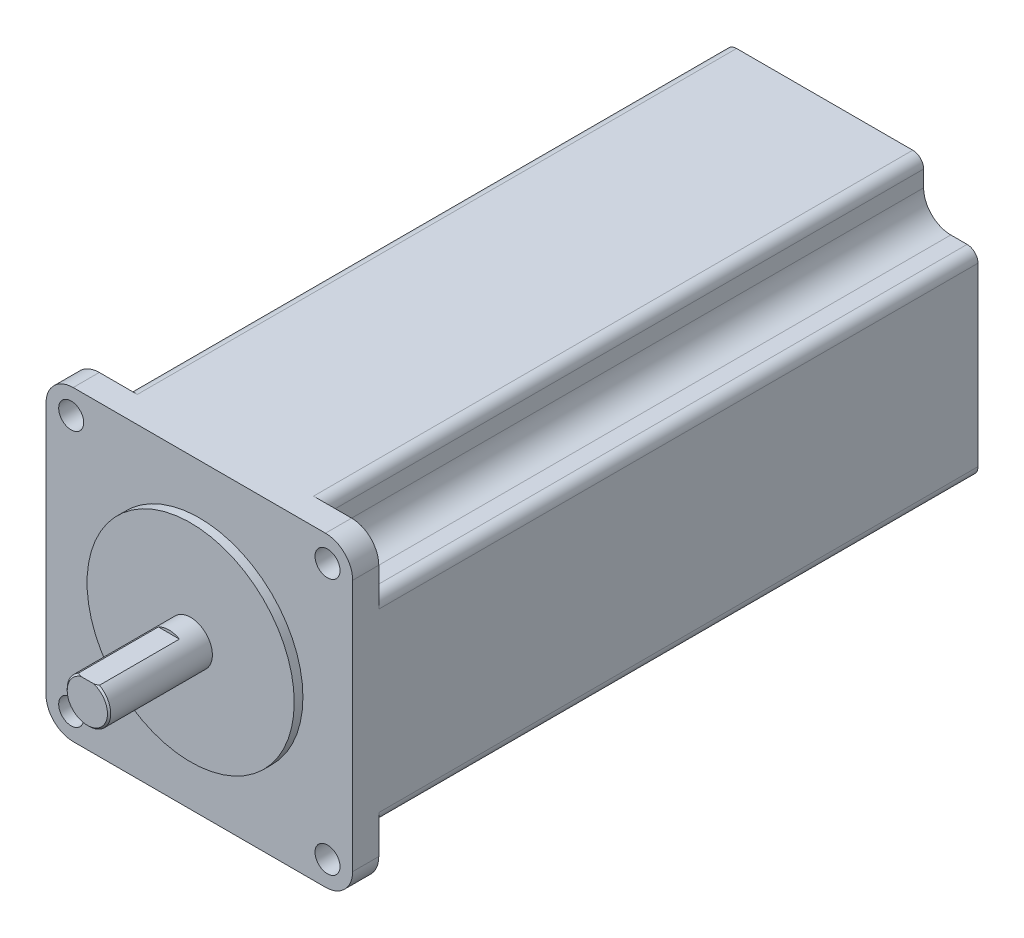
from build123d import *

# Parameters (mm, degrees)
SKETCH_1_R          = 19.05
EXTRUDE_1_DEPTH     = 1.6
SKETCH_2_R          = 4
EXTRUDE_2_DEPTH     = 19
EXTRUDE_3_DEPTH     = 115
CUT_EXTRUDE_START   = -110.2
CUT_EXTRUDE_2_DEPTH = 110.2
SKETCH_6_R          = 2.3
CUT_EXTRUDE_3_DEPTH = 49.7
CHAMFER_1_SIZE      = 0.3
CUT_EXTRUDE_START_2 = -15
CUT_EXTRUDE_4_DEPTH = 15


with BuildPart() as part:
    # Sketch 1 → Extrude 1 (new body)
    with BuildSketch(Plane.XY):
        Circle(SKETCH_1_R)
    extrude(amount=-EXTRUDE_1_DEPTH)

    # Sketch 2 → Extrude 2 (add)
    with BuildSketch(Plane.XY):
        Circle(SKETCH_2_R)
    extrude(amount=EXTRUDE_2_DEPTH)

    # Sketch 4 → Extrude 3 (add)
    with BuildSketch(Plane(origin=(0, 0, -1.6), x_dir=(-1, 0, 0), z_dir=(0, 0, -1))):
        with BuildLine():
            Line((0, 28.2), (23.2, 28.2))
            ThreePointArc((23.2, 28.2), (26.735533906, 26.735533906), (28.2, 23.2))
            Line((28.2, 23.2), (28.2, -23.2))
            ThreePointArc((28.2, -23.2), (26.735533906, -26.735533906), (23.2, -28.2))
            Line((23.2, -28.2), (-23.2, -28.2))
            ThreePointArc((-23.2, -28.2), (-26.735533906, -26.735533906), (-28.2, -23.2))
            Line((-28.2, -23.2), (-28.2, 23.2))
            ThreePointArc((-28.2, 23.2), (-26.735533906, 26.735533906), (-23.2, 28.2))
            Line((-23.2, 28.2), (0, 28.2))
        make_face()
    extrude(amount=EXTRUDE_3_DEPTH)

    # Sketch 5 → Cut-Extrude 2 (cut)
    with BuildSketch(Plane(origin=(0, 0, -116.6), x_dir=(-1, 0, 0), z_dir=(0, 0, -1)).offset(CUT_EXTRUDE_START)):
        with BuildLine():
            Line((11.494440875, 28.2), (16.2, 28.2))
            ThreePointArc((16.2, 28.2), (17.614213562, 27.614213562), (18.2, 26.2))
            Line((18.2, 26.2), (18.2, 23.2))
            ThreePointArc((18.2, 23.2), (19.664466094, 19.664466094), (23.2, 18.2))
            Line((23.2, 18.2), (26.2, 18.2))
            ThreePointArc((26.2, 18.2), (27.614213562, 17.614213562), (28.2, 16.2))
            Line((28.2, 16.2), (28.2, 9.920361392))
            Line((28.2, 9.920361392), (36.460073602, 9.920361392))
            Line((36.460073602, 9.920361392), (36.460073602, 32.177113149))
            Line((36.460073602, 32.177113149), (11.494440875, 32.177113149))
            Line((11.494440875, 32.177113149), (11.494440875, 28.2))
        make_face()
        with BuildLine():
            Line((-11.494440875, 32.177113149), (-11.494440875, 28.2))
            Line((-11.494440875, 28.2), (-16.2, 28.2))
            ThreePointArc((-16.2, 28.2), (-17.614213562, 27.614213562), (-18.2, 26.2))
            Line((-18.2, 26.2), (-18.2, 23.2))
            ThreePointArc((-18.2, 23.2), (-19.664466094, 19.664466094), (-23.2, 18.2))
            Line((-23.2, 18.2), (-26.2, 18.2))
            ThreePointArc((-26.2, 18.2), (-27.614213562, 17.614213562), (-28.2, 16.2))
            Line((-28.2, 16.2), (-28.2, 9.920361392))
            Line((-28.2, 9.920361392), (-36.460073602, 9.920361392))
            Line((-36.460073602, 9.920361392), (-36.460073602, 32.177113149))
            Line((-36.460073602, 32.177113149), (-11.494440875, 32.177113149))
        make_face()
        with BuildLine():
            Line((11.494440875, -32.177113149), (11.494440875, -28.2))
            Line((11.494440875, -28.2), (16.2, -28.2))
            ThreePointArc((16.2, -28.2), (17.614213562, -27.614213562), (18.2, -26.2))
            Line((18.2, -26.2), (18.2, -23.2))
            ThreePointArc((18.2, -23.2), (19.664466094, -19.664466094), (23.2, -18.2))
            Line((23.2, -18.2), (26.2, -18.2))
            ThreePointArc((26.2, -18.2), (27.614213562, -17.614213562), (28.2, -16.2))
            Line((28.2, -16.2), (28.2, -9.920361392))
            Line((28.2, -9.920361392), (36.460073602, -9.920361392))
            Line((36.460073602, -9.920361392), (36.460073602, -32.177113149))
            Line((36.460073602, -32.177113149), (11.494440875, -32.177113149))
        make_face()
        with BuildLine():
            Line((-11.494440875, -28.2), (-16.2, -28.2))
            ThreePointArc((-16.2, -28.2), (-17.614213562, -27.614213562), (-18.2, -26.2))
            Line((-18.2, -26.2), (-18.2, -23.2))
            ThreePointArc((-18.2, -23.2), (-19.664466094, -19.664466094), (-23.2, -18.2))
            Line((-23.2, -18.2), (-26.2, -18.2))
            ThreePointArc((-26.2, -18.2), (-27.614213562, -17.614213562), (-28.2, -16.2))
            Line((-28.2, -16.2), (-28.2, -9.920361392))
            Line((-28.2, -9.920361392), (-36.460073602, -9.920361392))
            Line((-36.460073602, -9.920361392), (-36.460073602, -32.177113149))
            Line((-36.460073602, -32.177113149), (-11.494440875, -32.177113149))
            Line((-11.494440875, -32.177113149), (-11.494440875, -28.2))
        make_face()
    extrude(amount=CUT_EXTRUDE_2_DEPTH, mode=Mode.SUBTRACT)

    # Sketch 6 → Cut-Extrude 3 (cut)
    with BuildSketch(Plane.XY.offset(-1.6)):
        with Locations((-23.57, 23.57)):
            Circle(SKETCH_6_R)
        with Locations((23.57, 23.57)):
            Circle(SKETCH_6_R)
        with Locations((23.57, -23.57)):
            Circle(SKETCH_6_R)
        with Locations((-23.57, -23.57)):
            Circle(SKETCH_6_R)
    extrude(amount=-CUT_EXTRUDE_3_DEPTH, mode=Mode.SUBTRACT)

    # Chamfer 1
    chamfer_1_edges = [part.edges().sort_by_distance(p)[0] for p in [
        (-4, 0, 19),
    ]]
    chamfer(chamfer_1_edges, length=CHAMFER_1_SIZE)

    # Sketch 9 → Cut-Extrude 4 (cut)
    with BuildSketch(Plane.XY.offset(19).offset(CUT_EXTRUDE_START_2)):
        with BuildLine():
            Line((-1.936491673, 3.5), (1.936491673, 3.5))
            ThreePointArc((1.936491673, 3.5), (0, 4), (-1.936491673, 3.5))
        make_face()
    extrude(amount=CUT_EXTRUDE_4_DEPTH, mode=Mode.SUBTRACT)


solid = part.part
